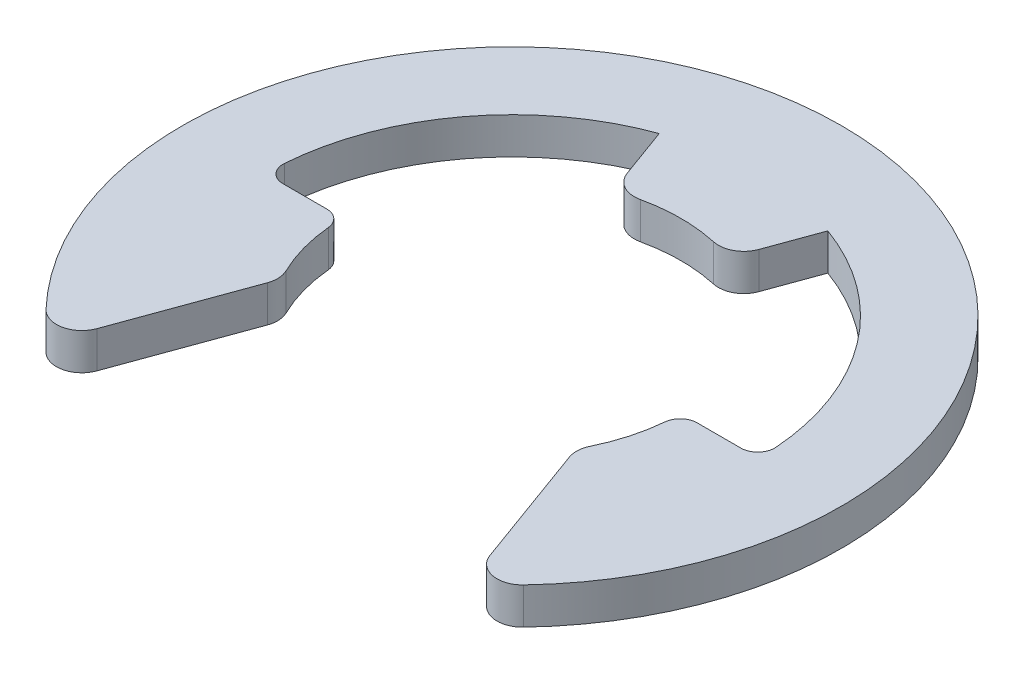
from build123d import *

# Parameters (mm, degrees)
BOSS_EXTRUDE1_DEPTH = 0.65
FILLET1_R           = 0.9
FILLET2_R           = 0.6


with BuildPart() as part:
    # Sketch2 → Boss-Extrude1 (new, symmetric)
    with BuildSketch(Plane(origin=(0, 0, 0), x_dir=(1, 0, 0), z_dir=(0, 1, 0))):
        with BuildLine():
            Line((-7.438492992, -9.030992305), (-5.225, -2.949470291))
            ThreePointArc((-5.225, -2.949470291), (-5.803016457, -1.524795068), (-6, 0))
            Line((-6, 0), (-8.75, 0))
            ThreePointArc((-8.75, 0), (-7.167580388, 5.018793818), (-2.992676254, 8.222310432))
            Line((-2.992676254, 8.222310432), (-2.05212086, 5.638155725))
            ThreePointArc((-2.05212086, 5.638155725), (0, 6), (2.05212086, 5.638155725))
            Line((2.05212086, 5.638155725), (2.992676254, 8.222310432))
            ThreePointArc((2.992676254, 8.222310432), (7.167580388, 5.018793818), (8.75, 0))
            Line((8.75, 0), (6, 0))
            ThreePointArc((6, 0), (5.803016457, -1.524795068), (5.225, -2.949470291))
            Line((5.225, -2.949470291), (7.438492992, -9.030992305))
            ThreePointArc((7.438492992, -9.030992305), (0, 11.7), (-7.438492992, -9.030992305))
        make_face()
    extrude(amount=BOSS_EXTRUDE1_DEPTH, both=True)

    # Fillet1
    fillet1_edges = [part.edges().sort_by_distance(p)[0] for p in [
        (-5.225, 0, 2.949470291),
        (-7.438492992, 0, 9.030992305),
        (7.438492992, 0, 9.030992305),
        (5.225, 0, 2.949470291),
        (2.05212086, 0, -5.638155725),
        (-2.05212086, 0, -5.638155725),
    ]]
    fillet(fillet1_edges, radius=FILLET1_R)

    # Fillet2
    fillet2_edges = [part.edges().sort_by_distance(p)[0] for p in [
        (-8.75, 0, 0),
        (-6, 0, 0),
        (6, 0, 0),
        (8.75, 0, 0),
    ]]
    fillet(fillet2_edges, radius=FILLET2_R)


solid = part.part
